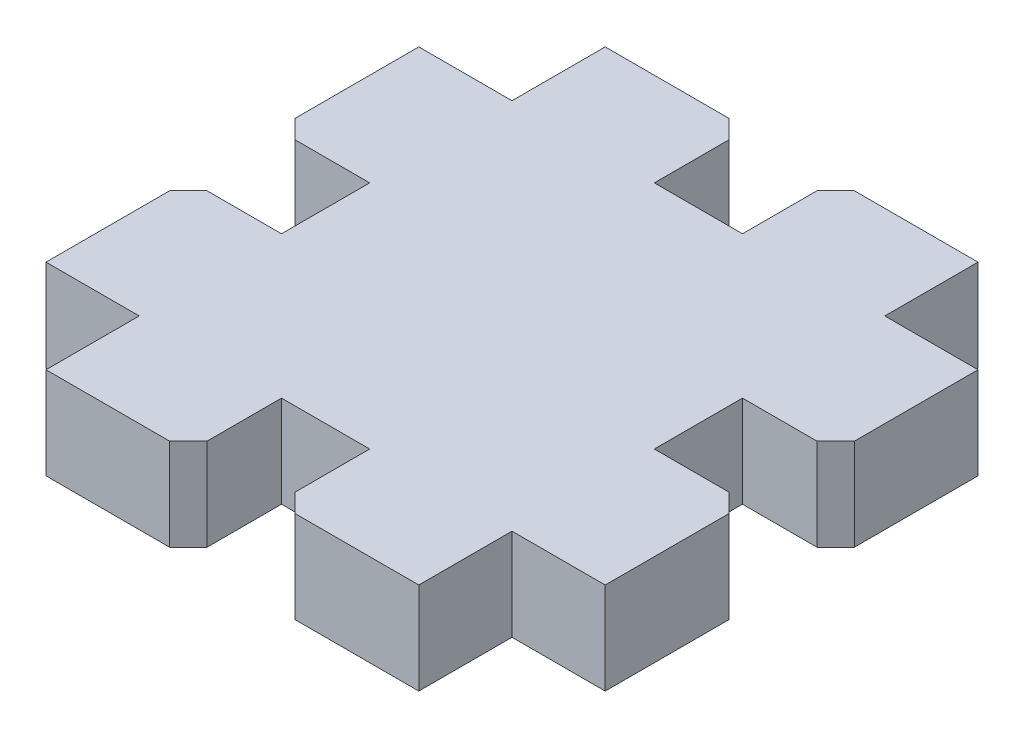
from build123d import *

# Parameters (mm, degrees)
BOSS_EXTRUDE1_DEPTH = 6.2611
CHAMFER1_SIZE       = 1.27


with BuildPart() as part:
    # Sketch1 → Boss-Extrude1 (new body)
    with BuildSketch(Plane(origin=(0, 0, 0), x_dir=(1, 0, 0), z_dir=(0, 1, 0))):
        Polygon((-3.00355, -11.264562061), (-3.00355, -4.914562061), (3.00355, -4.914562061), (3.00355, -11.264562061), (12.7, -11.264562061), (12.7, -4.914562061), (19.05, -4.914562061), (19.05, 4.781887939), (12.7, 4.781887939), (12.7, 10.788987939), (19.05, 10.788987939), (19.05, 20.485437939), (12.7, 20.485437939), (12.7, 26.835437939), (3.00355, 26.835437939), (3.00355, 20.485437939), (-3.00355, 20.485437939), (-3.00355, 26.835437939), (-12.7, 26.835437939), (-12.7, 20.485437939), (-19.05, 20.485437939), (-19.05, 10.788987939), (-12.7, 10.788987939), (-12.7, 4.781887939), (-19.05, 4.781887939), (-19.05, -4.914562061), (-12.7, -4.914562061), (-12.7, -11.264562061), align=None)
    extrude(amount=BOSS_EXTRUDE1_DEPTH)

    # Chamfer1
    chamfer1_edges = [part.edges().sort_by_distance(p)[0] for p in [
        (-19.05, 3.13055, -4.781887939),
        (-19.05, 3.13055, -10.788987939),
        (-3.00355, 3.13055, -26.835437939),
        (3.00355, 3.13055, -26.835437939),
        (19.05, 3.13055, -10.788987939),
        (19.05, 3.13055, -4.781887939),
        (3.00355, 3.13055, 11.264562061),
        (-3.00355, 3.13055, 11.264562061),
    ]]
    chamfer(chamfer1_edges, length=CHAMFER1_SIZE)


solid = part.part
